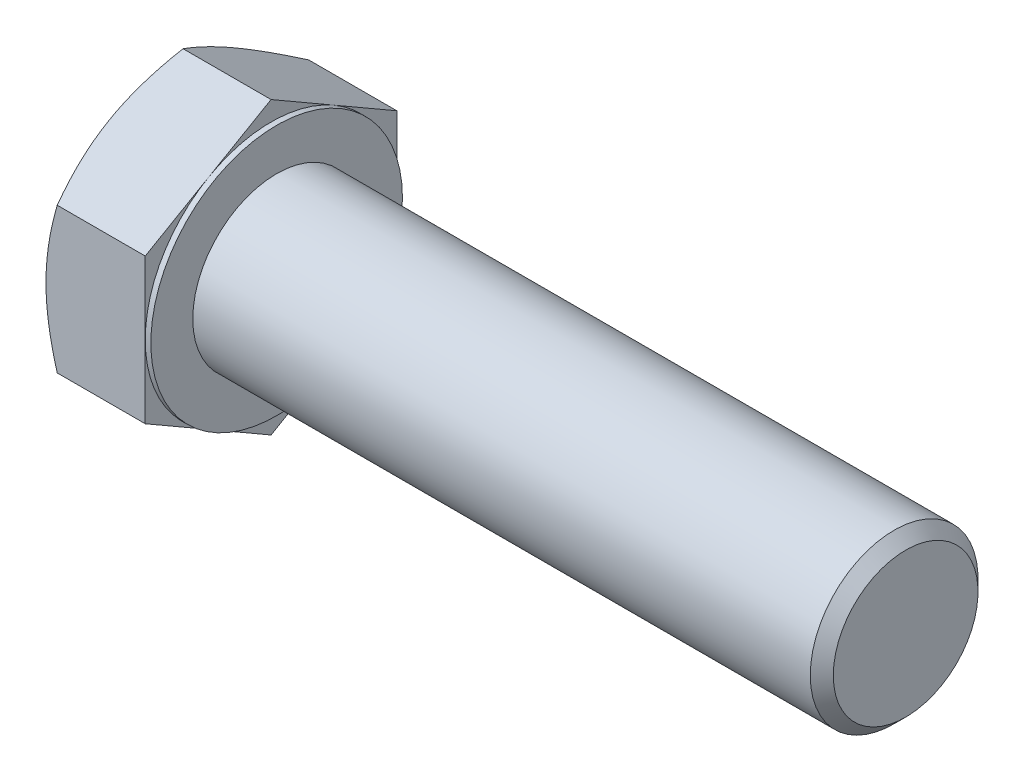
ISO-10303-21;
HEADER;
FILE_DESCRIPTION(('STEP AP214'),'2;1');
FILE_NAME('part.step','',(''),(''),'','','');
FILE_SCHEMA(('AUTOMOTIVE_DESIGN { 1 0 10303 214 1 1 1 1 }'));
ENDSEC;
DATA;
#1=APPLICATION_CONTEXT('core data for automotive mechanical design processes');
#2=APPLICATION_PROTOCOL_DEFINITION('international standard','automotive_design',2000,#1);
#3=PRODUCT_CONTEXT('',#1,'mechanical');
#4=PRODUCT('Part','Part','',(#3));
#5=PRODUCT_RELATED_PRODUCT_CATEGORY('part','',(#4));
#6=PRODUCT_DEFINITION_FORMATION('','',#4);
#7=PRODUCT_DEFINITION_CONTEXT('part definition',#1,'design');
#8=PRODUCT_DEFINITION('design','',#6,#7);
#9=PRODUCT_DEFINITION_SHAPE('','',#8);
#10=(LENGTH_UNIT() NAMED_UNIT(*) SI_UNIT(.MILLI.,.METRE.));
#11=(NAMED_UNIT(*) PLANE_ANGLE_UNIT() SI_UNIT($,.RADIAN.));
#12=(NAMED_UNIT(*) SI_UNIT($,.STERADIAN.) SOLID_ANGLE_UNIT());
#13=UNCERTAINTY_MEASURE_WITH_UNIT(LENGTH_MEASURE(1.E-05),#10,'distance_accuracy_value','');
#14=(GEOMETRIC_REPRESENTATION_CONTEXT(3) GLOBAL_UNCERTAINTY_ASSIGNED_CONTEXT((#13)) GLOBAL_UNIT_ASSIGNED_CONTEXT((#10,
#11,#12)) REPRESENTATION_CONTEXT('',''));
#15=CARTESIAN_POINT('',(0.,0.,0.));
#16=DIRECTION('',(0.,0.,1.));
#17=DIRECTION('',(1.,0.,0.));
#18=AXIS2_PLACEMENT_3D('',#15,#16,#17);
#19=CARTESIAN_POINT('',(15.,20.7846096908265,0.));
#20=DIRECTION('',(1.,0.,0.));
#21=DIRECTION('',(0.,0.,-1.));
#22=AXIS2_PLACEMENT_3D('',#19,#20,#21);
#23=PLANE('',#22);
#24=CARTESIAN_POINT('',(15.,0.,0.));
#25=DIRECTION('',(1.,0.,0.));
#26=DIRECTION('',(0.,0.,-1.));
#27=AXIS2_PLACEMENT_3D('',#24,#25,#26);
#28=CIRCLE('',#27,12.);
#29=CARTESIAN_POINT('',(15.,0.,-12.));
#30=VERTEX_POINT('',#29);
#31=EDGE_CURVE('E287',#30,#30,#28,.F.);
#32=ORIENTED_EDGE('',*,*,#31,.T.);
#33=EDGE_LOOP('',(#32));
#34=FACE_BOUND('',#33,.T.);
#35=CARTESIAN_POINT('',(15.,0.,0.));
#36=DIRECTION('',(1.,0.,0.));
#37=DIRECTION('',(0.,0.,-1.));
#38=AXIS2_PLACEMENT_3D('',#35,#36,#37);
#39=CIRCLE('',#38,18.);
#40=CARTESIAN_POINT('',(15.,0.,-18.));
#41=VERTEX_POINT('',#40);
#42=EDGE_CURVE('E306',#41,#41,#39,.T.);
#43=ORIENTED_EDGE('',*,*,#42,.T.);
#44=EDGE_LOOP('',(#43));
#45=FACE_BOUND('',#44,.T.);
#46=ADVANCED_FACE('F41',(#34,#45),#23,.T.);
#47=CARTESIAN_POINT('',(0.,0.,0.));
#48=DIRECTION('',(-1.,0.,0.));
#49=DIRECTION('',(0.,0.,1.));
#50=AXIS2_PLACEMENT_3D('',#47,#48,#49);
#51=CYLINDRICAL_SURFACE('',#50,12.);
#52=ORIENTED_EDGE('',*,*,#31,.F.);
#53=EDGE_LOOP('',(#52));
#54=FACE_BOUND('',#53,.T.);
#55=CARTESIAN_POINT('',(103.352,0.,0.));
#56=DIRECTION('',(-1.,0.,0.));
#57=DIRECTION('',(0.,0.,1.));
#58=AXIS2_PLACEMENT_3D('',#55,#56,#57);
#59=CIRCLE('',#58,12.);
#60=CARTESIAN_POINT('',(103.352,0.,12.));
#61=VERTEX_POINT('',#60);
#62=EDGE_CURVE('E284',#61,#61,#59,.T.);
#63=ORIENTED_EDGE('',*,*,#62,.T.);
#64=EDGE_LOOP('',(#63));
#65=FACE_BOUND('',#64,.T.);
#66=ADVANCED_FACE('F256',(#54,#65),#51,.T.);
#67=CARTESIAN_POINT('',(105.,0.,0.));
#68=DIRECTION('',(-1.,0.,0.));
#69=DIRECTION('',(0.,0.,1.));
#70=AXIS2_PLACEMENT_3D('',#67,#68,#69);
#71=CONICAL_SURFACE('',#70,10.352,0.785398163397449);
#72=ORIENTED_EDGE('',*,*,#62,.F.);
#73=EDGE_LOOP('',(#72));
#74=FACE_BOUND('',#73,.T.);
#75=CARTESIAN_POINT('',(105.,0.,0.));
#76=DIRECTION('',(-1.,0.,0.));
#77=DIRECTION('',(0.,0.,1.));
#78=AXIS2_PLACEMENT_3D('',#75,#76,#77);
#79=CIRCLE('',#78,10.352);
#80=CARTESIAN_POINT('',(105.,0.,10.352));
#81=VERTEX_POINT('',#80);
#82=EDGE_CURVE('E282',#81,#81,#79,.T.);
#83=ORIENTED_EDGE('',*,*,#82,.T.);
#84=EDGE_LOOP('',(#83));
#85=FACE_BOUND('',#84,.T.);
#86=ADVANCED_FACE('F263',(#74,#85),#71,.T.);
#87=CARTESIAN_POINT('',(105.,0.,0.));
#88=DIRECTION('',(-1.,0.,0.));
#89=DIRECTION('',(0.,0.,1.));
#90=AXIS2_PLACEMENT_3D('',#87,#88,#89);
#91=PLANE('',#90);
#92=ORIENTED_EDGE('',*,*,#82,.F.);
#93=EDGE_LOOP('',(#92));
#94=FACE_BOUND('',#93,.T.);
#95=ADVANCED_FACE('F270',(#94),#91,.F.);
#96=CARTESIAN_POINT('',(14.2,18.,0.));
#97=DIRECTION('',(1.,0.,0.));
#98=DIRECTION('',(0.,0.,-1.));
#99=AXIS2_PLACEMENT_3D('',#96,#97,#98);
#100=PLANE('',#99);
#101=DIRECTION('',(0.,0.500000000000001,0.866025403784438));
#102=VECTOR('',#101,1.);
#103=CARTESIAN_POINT('',(14.2,10.3923048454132,-18.));
#104=LINE('',#103,#102);
#105=CARTESIAN_POINT('',(14.2,10.3923048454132,-18.));
#106=VERTEX_POINT('',#105);
#107=CARTESIAN_POINT('',(14.2,15.5884572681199,-9.00000000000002));
#108=VERTEX_POINT('',#107);
#109=EDGE_CURVE('E174',#106,#108,#104,.T.);
#110=ORIENTED_EDGE('',*,*,#109,.T.);
#111=CARTESIAN_POINT('',(14.2,0.,0.));
#112=DIRECTION('',(-1.,0.,0.));
#113=DIRECTION('',(0.,0.,1.));
#114=AXIS2_PLACEMENT_3D('',#111,#112,#113);
#115=CIRCLE('',#114,18.);
#116=CARTESIAN_POINT('',(14.2,0.,-18.));
#117=VERTEX_POINT('',#116);
#118=EDGE_CURVE('E57',#108,#117,#115,.T.);
#119=ORIENTED_EDGE('',*,*,#118,.T.);
#120=DIRECTION('',(0.,1.,0.));
#121=VECTOR('',#120,1.);
#122=CARTESIAN_POINT('',(14.2,10.3923048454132,-18.));
#123=LINE('',#122,#121);
#124=EDGE_CURVE('E46',#117,#106,#123,.T.);
#125=ORIENTED_EDGE('',*,*,#124,.T.);
#126=EDGE_LOOP('',(#110,#119,#125));
#127=FACE_BOUND('',#126,.T.);
#128=ADVANCED_FACE('F273',(#127),#100,.T.);
#129=CARTESIAN_POINT('',(14.2,20.7846096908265,0.));
#130=VERTEX_POINT('',#129);
#131=EDGE_CURVE('E172',#108,#130,#104,.T.);
#132=ORIENTED_EDGE('',*,*,#131,.T.);
#133=DIRECTION('',(0.,-0.500000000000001,0.866025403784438));
#134=VECTOR('',#133,1.);
#135=CARTESIAN_POINT('',(14.2,20.7846096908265,0.));
#136=LINE('',#135,#134);
#137=CARTESIAN_POINT('',(14.2,15.5884572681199,9.00000000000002));
#138=VERTEX_POINT('',#137);
#139=EDGE_CURVE('E171',#130,#138,#136,.T.);
#140=ORIENTED_EDGE('',*,*,#139,.T.);
#141=EDGE_CURVE('E160',#138,#108,#115,.T.);
#142=ORIENTED_EDGE('',*,*,#141,.T.);
#143=EDGE_LOOP('',(#132,#140,#142));
#144=FACE_BOUND('',#143,.T.);
#145=ADVANCED_FACE('F278',(#144),#100,.T.);
#146=CARTESIAN_POINT('',(14.2,10.3923048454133,18.));
#147=VERTEX_POINT('',#146);
#148=EDGE_CURVE('E139',#138,#147,#136,.T.);
#149=ORIENTED_EDGE('',*,*,#148,.T.);
#150=DIRECTION('',(0.,-1.,0.));
#151=VECTOR('',#150,1.);
#152=CARTESIAN_POINT('',(14.2,10.3923048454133,18.));
#153=LINE('',#152,#151);
#154=CARTESIAN_POINT('',(14.2,0.,18.));
#155=VERTEX_POINT('',#154);
#156=EDGE_CURVE('E133',#147,#155,#153,.T.);
#157=ORIENTED_EDGE('',*,*,#156,.T.);
#158=EDGE_CURVE('E137',#155,#138,#115,.T.);
#159=ORIENTED_EDGE('',*,*,#158,.T.);
#160=EDGE_LOOP('',(#149,#157,#159));
#161=FACE_BOUND('',#160,.T.);
#162=ADVANCED_FACE('F135',(#161),#100,.T.);
#163=CARTESIAN_POINT('',(14.2,-10.3923048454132,18.));
#164=VERTEX_POINT('',#163);
#165=EDGE_CURVE('E143',#155,#164,#153,.T.);
#166=ORIENTED_EDGE('',*,*,#165,.T.);
#167=DIRECTION('',(0.,-0.500000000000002,-0.866025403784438));
#168=VECTOR('',#167,1.);
#169=CARTESIAN_POINT('',(14.2,-20.7846096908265,0.));
#170=LINE('',#169,#168);
#171=CARTESIAN_POINT('',(14.2,-15.5884572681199,9.00000000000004));
#172=VERTEX_POINT('',#171);
#173=EDGE_CURVE('E150',#164,#172,#170,.T.);
#174=ORIENTED_EDGE('',*,*,#173,.T.);
#175=EDGE_CURVE('E147',#172,#155,#115,.T.);
#176=ORIENTED_EDGE('',*,*,#175,.T.);
#177=EDGE_LOOP('',(#166,#174,#176));
#178=FACE_BOUND('',#177,.T.);
#179=ADVANCED_FACE('F148',(#178),#100,.T.);
#180=CARTESIAN_POINT('',(14.2,-20.7846096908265,0.));
#181=VERTEX_POINT('',#180);
#182=EDGE_CURVE('E166',#172,#181,#170,.T.);
#183=ORIENTED_EDGE('',*,*,#182,.T.);
#184=DIRECTION('',(0.,0.5,-0.866025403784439));
#185=VECTOR('',#184,1.);
#186=CARTESIAN_POINT('',(14.2,-10.3923048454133,-18.));
#187=LINE('',#186,#185);
#188=CARTESIAN_POINT('',(14.2,-15.5884572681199,-9.));
#189=VERTEX_POINT('',#188);
#190=EDGE_CURVE('E342',#181,#189,#187,.T.);
#191=ORIENTED_EDGE('',*,*,#190,.T.);
#192=EDGE_CURVE('E154',#189,#172,#115,.T.);
#193=ORIENTED_EDGE('',*,*,#192,.T.);
#194=EDGE_LOOP('',(#183,#191,#193));
#195=FACE_BOUND('',#194,.T.);
#196=ADVANCED_FACE('F347',(#195),#100,.T.);
#197=CARTESIAN_POINT('',(14.2,-10.3923048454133,-18.));
#198=VERTEX_POINT('',#197);
#199=EDGE_CURVE('E161',#189,#198,#187,.T.);
#200=ORIENTED_EDGE('',*,*,#199,.T.);
#201=EDGE_CURVE('E11',#198,#117,#123,.T.);
#202=ORIENTED_EDGE('',*,*,#201,.T.);
#203=EDGE_CURVE('E360',#117,#189,#115,.T.);
#204=ORIENTED_EDGE('',*,*,#203,.T.);
#205=EDGE_LOOP('',(#200,#202,#204));
#206=FACE_BOUND('',#205,.T.);
#207=ADVANCED_FACE('F279',(#206),#100,.T.);
#208=CARTESIAN_POINT('',(0.,0.,0.));
#209=DIRECTION('',(-1.,0.,0.));
#210=DIRECTION('',(0.,0.,1.));
#211=AXIS2_PLACEMENT_3D('',#208,#209,#210);
#212=CYLINDRICAL_SURFACE('',#211,18.);
#213=ORIENTED_EDGE('',*,*,#118,.F.);
#214=ORIENTED_EDGE('',*,*,#141,.F.);
#215=ORIENTED_EDGE('',*,*,#158,.F.);
#216=ORIENTED_EDGE('',*,*,#175,.F.);
#217=ORIENTED_EDGE('',*,*,#192,.F.);
#218=ORIENTED_EDGE('',*,*,#203,.F.);
#219=EDGE_LOOP('',(#213,#214,#215,#216,#217,#218));
#220=FACE_BOUND('',#219,.T.);
#221=ORIENTED_EDGE('',*,*,#42,.F.);
#222=EDGE_LOOP('',(#221));
#223=FACE_BOUND('',#222,.T.);
#224=ADVANCED_FACE('F157',(#220,#223),#212,.T.);
#225=CARTESIAN_POINT('',(0.,20.7846096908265,0.));
#226=DIRECTION('',(1.,0.,0.));
#227=DIRECTION('',(0.,0.,-1.));
#228=AXIS2_PLACEMENT_3D('',#225,#226,#227);
#229=PLANE('',#228);
#230=CARTESIAN_POINT('',(0.,0.,0.));
#231=DIRECTION('',(1.,0.,0.));
#232=DIRECTION('',(0.,0.,-1.));
#233=AXIS2_PLACEMENT_3D('',#230,#231,#232);
#234=CIRCLE('',#233,18.);
#235=CARTESIAN_POINT('',(0.,0.,-18.));
#236=VERTEX_POINT('',#235);
#237=CARTESIAN_POINT('',(0.,15.5884572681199,-9.00000000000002));
#238=VERTEX_POINT('',#237);
#239=EDGE_CURVE('E305',#236,#238,#234,.T.);
#240=ORIENTED_EDGE('',*,*,#239,.F.);
#241=CARTESIAN_POINT('',(0.,-15.5884572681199,-9.));
#242=VERTEX_POINT('',#241);
#243=EDGE_CURVE('E302',#242,#236,#234,.T.);
#244=ORIENTED_EDGE('',*,*,#243,.F.);
#245=CARTESIAN_POINT('',(0.,-15.5884572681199,9.00000000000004));
#246=VERTEX_POINT('',#245);
#247=EDGE_CURVE('E304',#246,#242,#234,.T.);
#248=ORIENTED_EDGE('',*,*,#247,.F.);
#249=CARTESIAN_POINT('',(0.,0.,18.));
#250=VERTEX_POINT('',#249);
#251=EDGE_CURVE('E314',#250,#246,#234,.T.);
#252=ORIENTED_EDGE('',*,*,#251,.F.);
#253=CARTESIAN_POINT('',(0.,0.,0.));
#254=DIRECTION('',(-1.,0.,0.));
#255=DIRECTION('',(0.,0.,1.));
#256=AXIS2_PLACEMENT_3D('',#253,#254,#255);
#257=CIRCLE('',#256,18.);
#258=CARTESIAN_POINT('',(0.,15.5884572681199,9.00000000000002));
#259=VERTEX_POINT('',#258);
#260=EDGE_CURVE('E175',#250,#259,#257,.T.);
#261=ORIENTED_EDGE('',*,*,#260,.T.);
#262=EDGE_CURVE('E309',#238,#259,#234,.T.);
#263=ORIENTED_EDGE('',*,*,#262,.F.);
#264=EDGE_LOOP('',(#240,#244,#248,#252,#261,#263));
#265=FACE_BOUND('',#264,.T.);
#266=ADVANCED_FACE('F206',(#265),#229,.F.);
#267=CARTESIAN_POINT('',(0.,0.,0.));
#268=DIRECTION('',(1.,0.,0.));
#269=DIRECTION('',(0.,0.,-1.));
#270=AXIS2_PLACEMENT_3D('',#267,#268,#269);
#271=CONICAL_SURFACE('',#270,18.,1.0471975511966);
#272=CARTESIAN_POINT('',(1.60776182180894,10.3921893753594,18.0002));
#273=CARTESIAN_POINT('',(1.47589336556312,10.6206079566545,17.6045674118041));
#274=CARTESIAN_POINT('',(1.35000889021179,10.8499174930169,17.2073916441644));
#275=CARTESIAN_POINT('',(1.11187123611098,11.310375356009,16.4098552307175));
#276=CARTESIAN_POINT('',(0.999622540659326,11.5415242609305,16.0094935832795));
#277=CARTESIAN_POINT('',(0.790265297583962,12.0061075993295,15.2048116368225));
#278=CARTESIAN_POINT('',(0.693192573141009,12.2395460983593,14.8004842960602));
#279=CARTESIAN_POINT('',(0.51627174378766,12.7080451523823,13.9890201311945));
#280=CARTESIAN_POINT('',(0.436422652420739,12.9431056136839,13.5818834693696));
#281=CARTESIAN_POINT('',(0.297345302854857,13.4088255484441,12.7752328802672));
#282=CARTESIAN_POINT('',(0.237656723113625,13.6394504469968,12.3757788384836));
#283=CARTESIAN_POINT('',(0.137572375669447,14.1017570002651,11.5750403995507));
#284=CARTESIAN_POINT('',(0.0971769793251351,14.3334386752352,11.1737559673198));
#285=CARTESIAN_POINT('',(0.0366989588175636,14.7971912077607,10.3705130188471));
#286=CARTESIAN_POINT('',(0.0165921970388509,15.0292612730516,9.96855587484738));
#287=CARTESIAN_POINT('',(-0.0028761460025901,15.4936156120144,9.16427056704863));
#288=CARTESIAN_POINT('',(-0.00223836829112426,15.7258998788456,8.76194241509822));
#289=CARTESIAN_POINT('',(0.0183335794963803,16.1601606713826,8.00978065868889));
#290=CARTESIAN_POINT('',(0.0357591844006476,16.3621681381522,7.65989346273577));
#291=CARTESIAN_POINT('',(0.0859690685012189,16.765701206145,6.96095368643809));
#292=CARTESIAN_POINT('',(0.118753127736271,16.9672268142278,6.61190109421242));
#293=CARTESIAN_POINT('',(0.199111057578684,17.3697198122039,5.91476277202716));
#294=CARTESIAN_POINT('',(0.246698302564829,17.5706865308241,5.56667820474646));
#295=CARTESIAN_POINT('',(0.355822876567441,17.9716632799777,4.87216610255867));
#296=CARTESIAN_POINT('',(0.417360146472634,18.1716733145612,4.52573856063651));
#297=CARTESIAN_POINT('',(0.624462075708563,18.7788295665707,3.47411308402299));
#298=CARTESIAN_POINT('',(0.790677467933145,19.1842175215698,2.77196054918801));
#299=CARTESIAN_POINT('',(1.1679181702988,19.9889486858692,1.37812528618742));
#300=CARTESIAN_POINT('',(1.3788548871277,20.3883021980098,0.686424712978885));
#301=CARTESIAN_POINT('',(1.60776182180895,20.7847251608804,-0.000200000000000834));
#302=B_SPLINE_CURVE_WITH_KNOTS('',3,(#272,#273,#274,#275,#276,#277,#278,#279,#280,#281,#282,
#283,#284,#285,#286,#287,#288,#289,#290,#291,#292,#293,#294,#295,#296,#297,#298,#299,#300,#301),
.UNSPECIFIED.,.F.,.F.,(4,2,2,2,2,2,2,2,2,2,2,2,2,2,4),(0.,1.42650335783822,2.85347447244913,
4.28376471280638,5.71397301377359,7.10888071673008,8.50381526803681,9.8970882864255,
11.2903182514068,12.5031974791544,13.7160593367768,14.9300201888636,16.1439758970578,
18.6253607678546,21.1018751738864),.UNSPECIFIED.);
#303=CARTESIAN_POINT('',(1.60769515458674,20.7846096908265,0.));
#304=VERTEX_POINT('',#303);
#305=EDGE_CURVE('E225',#259,#304,#302,.T.);
#306=ORIENTED_EDGE('',*,*,#305,.T.);
#307=CARTESIAN_POINT('',(1.60776182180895,20.7847251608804,0.0002));
#308=CARTESIAN_POINT('',(1.47589336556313,20.5563065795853,-0.395432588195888));
#309=CARTESIAN_POINT('',(1.3500088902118,20.3269970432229,-0.79260835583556));
#310=CARTESIAN_POINT('',(1.11187123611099,19.8665391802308,-1.59014476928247));
#311=CARTESIAN_POINT('',(0.999622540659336,19.6353902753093,-1.99050641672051));
#312=CARTESIAN_POINT('',(0.790265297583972,19.1708069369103,-2.79518836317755));
#313=CARTESIAN_POINT('',(0.69319257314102,18.9373684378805,-3.19951570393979));
#314=CARTESIAN_POINT('',(0.516271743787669,18.4688693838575,-4.01097986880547));
#315=CARTESIAN_POINT('',(0.436422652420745,18.2338089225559,-4.41811653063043));
#316=CARTESIAN_POINT('',(0.297345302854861,17.7680889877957,-5.22476711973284));
#317=CARTESIAN_POINT('',(0.237656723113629,17.537464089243,-5.62422116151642));
#318=CARTESIAN_POINT('',(0.13757237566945,17.0751575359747,-6.42495960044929));
#319=CARTESIAN_POINT('',(0.0971769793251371,16.8434758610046,-6.82624403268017));
#320=CARTESIAN_POINT('',(0.0366989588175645,16.3797233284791,-7.62948698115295));
#321=CARTESIAN_POINT('',(0.0165921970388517,16.1476532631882,-8.03144412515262));
#322=CARTESIAN_POINT('',(-0.00287614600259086,15.6832989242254,-8.83572943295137));
#323=CARTESIAN_POINT('',(-0.00223836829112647,15.4510146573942,-9.23805758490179));
#324=CARTESIAN_POINT('',(0.0183335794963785,15.0167538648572,-9.99021934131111));
#325=CARTESIAN_POINT('',(0.0357591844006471,14.8147463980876,-10.3401065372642));
#326=CARTESIAN_POINT('',(0.0859690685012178,14.4112133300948,-11.0390463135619));
#327=CARTESIAN_POINT('',(0.118753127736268,14.209687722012,-11.3880989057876));
#328=CARTESIAN_POINT('',(0.199111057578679,13.8071947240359,-12.0852372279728));
#329=CARTESIAN_POINT('',(0.246698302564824,13.6062280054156,-12.4333217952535));
#330=CARTESIAN_POINT('',(0.355822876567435,13.2052512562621,-13.1278338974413));
#331=CARTESIAN_POINT('',(0.417360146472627,13.0052412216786,-13.4742614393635));
#332=CARTESIAN_POINT('',(0.624462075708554,12.3980849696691,-14.525886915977));
#333=CARTESIAN_POINT('',(0.790677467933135,11.99269701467,-15.228039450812));
#334=CARTESIAN_POINT('',(1.16791817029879,11.1879658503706,-16.6218747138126));
#335=CARTESIAN_POINT('',(1.37885488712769,10.78861233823,-17.3135752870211));
#336=CARTESIAN_POINT('',(1.60776182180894,10.3921893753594,-18.0002));
#337=B_SPLINE_CURVE_WITH_KNOTS('',3,(#307,#308,#309,#310,#311,#312,#313,#314,#315,#316,#317,
#318,#319,#320,#321,#322,#323,#324,#325,#326,#327,#328,#329,#330,#331,#332,#333,#334,#335,#336),
.UNSPECIFIED.,.F.,.F.,(4,2,2,2,2,2,2,2,2,2,2,2,2,2,4),(0.,1.42650335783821,2.85347447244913,
4.28376471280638,5.71397301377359,7.10888071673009,8.50381526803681,9.89708828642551,
11.2903182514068,12.5031974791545,13.7160593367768,14.9300201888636,16.1439758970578,
18.6253607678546,21.1018751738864),.UNSPECIFIED.);
#338=EDGE_CURVE('E65',#304,#238,#337,.T.);
#339=ORIENTED_EDGE('',*,*,#338,.T.);
#340=ORIENTED_EDGE('',*,*,#262,.T.);
#341=EDGE_LOOP('',(#306,#339,#340));
#342=FACE_BOUND('',#341,.T.);
#343=ADVANCED_FACE('F356',(#342),#271,.T.);
#344=CARTESIAN_POINT('',(8.808427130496,-27.9643402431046,18.));
#345=CARTESIAN_POINT('',(8.61750677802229,-27.5710662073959,18.));
#346=CARTESIAN_POINT('',(8.42753472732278,-27.1773320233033,18.));
#347=CARTESIAN_POINT('',(8.04970189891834,-26.3888473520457,18.));
#348=CARTESIAN_POINT('',(7.86184114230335,-25.9940968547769,18.));
#349=CARTESIAN_POINT('',(7.30169863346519,-24.8080724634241,18.));
#350=CARTESIAN_POINT('',(6.93291289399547,-24.0151412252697,18.));
#351=CARTESIAN_POINT('',(6.20490967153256,-22.4196974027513,18.));
#352=CARTESIAN_POINT('',(5.84575478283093,-21.6171561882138,18.));
#353=CARTESIAN_POINT('',(5.14207064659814,-20.0057089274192,18.));
#354=CARTESIAN_POINT('',(4.79754071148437,-19.1968031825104,18.));
#355=CARTESIAN_POINT('',(4.11611022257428,-17.5450041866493,18.));
#356=CARTESIAN_POINT('',(3.77981809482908,-16.7018586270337,18.));
#357=CARTESIAN_POINT('',(3.13256514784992,-15.0057154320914,18.));
#358=CARTESIAN_POINT('',(2.82160716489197,-14.1527167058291,18.));
#359=CARTESIAN_POINT('',(2.23315455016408,-12.43711867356,18.));
#360=CARTESIAN_POINT('',(1.95559259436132,-11.5745426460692,18.));
#361=CARTESIAN_POINT('',(1.44279031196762,-9.83693542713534,18.));
#362=CARTESIAN_POINT('',(1.20753670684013,-8.96190823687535,18.));
#363=CARTESIAN_POINT('',(0.895522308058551,-7.64230427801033,18.));
#364=CARTESIAN_POINT('',(0.798539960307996,-7.20248011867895,18.));
#365=CARTESIAN_POINT('',(0.619346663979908,-6.31981731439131,18.));
#366=CARTESIAN_POINT('',(0.537135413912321,-5.87697873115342,18.));
#367=CARTESIAN_POINT('',(0.388933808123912,-4.98859702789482,18.));
#368=CARTESIAN_POINT('',(0.322942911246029,-4.54305399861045,18.));
#369=CARTESIAN_POINT('',(0.208492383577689,-3.64970631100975,18.));
#370=CARTESIAN_POINT('',(0.160032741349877,-3.20190165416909,18.));
#371=CARTESIAN_POINT('',(0.0822220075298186,-2.3105496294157,18.));
#372=CARTESIAN_POINT('',(0.0526283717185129,-1.86702356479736,18.));
#373=CARTESIAN_POINT('',(0.0122265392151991,-0.979118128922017,18.));
#374=CARTESIAN_POINT('',(0.001418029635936,-0.534738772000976,18.));
#375=CARTESIAN_POINT('',(-0.00115631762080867,0.354079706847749,18.));
#376=CARTESIAN_POINT('',(0.00707792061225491,0.798518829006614,18.));
#377=CARTESIAN_POINT('',(0.0423876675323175,1.68665283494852,18.));
#378=CARTESIAN_POINT('',(0.0694640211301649,2.13034768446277,18.));
#379=CARTESIAN_POINT('',(0.156482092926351,3.19520589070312,18.));
#380=CARTESIAN_POINT('',(0.225281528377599,3.81565824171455,18.));
#381=CARTESIAN_POINT('',(0.395990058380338,5.05199420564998,18.));
#382=CARTESIAN_POINT('',(0.497903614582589,5.66787719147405,18.));
#383=CARTESIAN_POINT('',(0.731215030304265,6.89447554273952,18.));
#384=CARTESIAN_POINT('',(0.862635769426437,7.50518651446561,18.));
#385=CARTESIAN_POINT('',(1.15094813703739,8.72049972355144,18.));
#386=CARTESIAN_POINT('',(1.30783938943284,9.3251020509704,18.));
#387=CARTESIAN_POINT('',(1.64698004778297,10.5414936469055,18.));
#388=CARTESIAN_POINT('',(1.82971241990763,11.1531473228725,18.));
#389=CARTESIAN_POINT('',(2.21414736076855,12.3704299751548,18.));
#390=CARTESIAN_POINT('',(2.41585005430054,12.9760589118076,18.));
#391=CARTESIAN_POINT('',(2.83501520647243,14.1815895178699,18.));
#392=CARTESIAN_POINT('',(3.05247247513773,14.7814930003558,18.));
#393=CARTESIAN_POINT('',(3.50057968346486,15.9763233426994,18.));
#394=CARTESIAN_POINT('',(3.73122947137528,16.5712502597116,18.));
#395=CARTESIAN_POINT('',(4.28861115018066,17.9702204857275,18.));
#396=CARTESIAN_POINT('',(4.62002515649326,18.7723954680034,18.));
#397=CARTESIAN_POINT('',(5.29890820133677,20.3699430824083,18.));
#398=CARTESIAN_POINT('',(5.64637822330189,21.1653152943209,18.));
#399=CARTESIAN_POINT('',(6.35417286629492,22.7505167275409,18.));
#400=CARTESIAN_POINT('',(6.7145003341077,23.5403446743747,18.));
#401=CARTESIAN_POINT('',(7.44542750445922,25.1152008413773,18.));
#402=CARTESIAN_POINT('',(7.81602698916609,25.9002291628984,18.));
#403=CARTESIAN_POINT('',(8.56599428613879,27.4671332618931,18.));
#404=CARTESIAN_POINT('',(8.94537123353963,28.2490046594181,18.));
#405=CARTESIAN_POINT('',(9.71100797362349,29.8093695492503,18.));
#406=CARTESIAN_POINT('',(10.0972677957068,30.5878630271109,18.));
#407=CARTESIAN_POINT('',(10.8754456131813,32.1418914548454,18.));
#408=CARTESIAN_POINT('',(11.2673628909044,32.9174267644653,18.));
#409=CARTESIAN_POINT('',(12.0559785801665,34.4660583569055,18.));
#410=CARTESIAN_POINT('',(12.4526769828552,35.2391546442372,18.));
#411=CARTESIAN_POINT('',(13.5822142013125,37.4263866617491,18.));
#412=CARTESIAN_POINT('',(14.3197969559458,38.8380724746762,18.));
#413=CARTESIAN_POINT('',(15.8050655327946,41.6561700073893,18.));
#414=CARTESIAN_POINT('',(16.5527517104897,43.0625815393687,18.));
#415=CARTESIAN_POINT('',(18.0539928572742,45.8677641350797,18.));
#416=CARTESIAN_POINT('',(18.8075285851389,47.2665455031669,18.));
#417=CARTESIAN_POINT('',(19.942334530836,49.3622270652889,18.));
#418=CARTESIAN_POINT('',(20.3213432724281,50.0603536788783,18.));
#419=CARTESIAN_POINT('',(21.0807116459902,51.4558704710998,18.));
#420=CARTESIAN_POINT('',(21.4610712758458,52.1532606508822,18.));
#421=CARTESIAN_POINT('',(21.8420286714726,52.850324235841,18.));
#422=B_SPLINE_CURVE_WITH_KNOTS('',3,(#344,#345,#346,#347,#348,#349,#350,#351,#352,#353,#354,
#355,#356,#357,#358,#359,#360,#361,#362,#363,#364,#365,#366,#367,#368,#369,#370,#371,#372,#373,
#374,#375,#376,#377,#378,#379,#380,#381,#382,#383,#384,#385,#386,#387,#388,#389,#390,#391,#392,
#393,#394,#395,#396,#397,#398,#399,#400,#401,#402,#403,#404,#405,#406,#407,#408,#409,#410,#411,
#412,#413,#414,#415,#416,#417,#418,#419,#420,#421),.UNSPECIFIED.,.F.,.F.,(4,2,2,2,2,2,2,2,2,2,2,
2,2,2,2,2,2,2,2,2,2,2,2,2,2,2,2,2,2,2,2,2,2,2,2,2,2,2,4),(0.,1.31149885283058,2.62301079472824,
5.24642021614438,7.88402931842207,10.5215142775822,13.2444150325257,15.9676202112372,
18.6852401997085,21.402005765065,22.7529669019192,24.1039004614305,25.454788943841,
26.8056765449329,28.1388267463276,29.4719547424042,30.8050880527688,32.138281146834,
34.0100119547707,35.8819950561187,37.7554347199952,39.628846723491,41.5435776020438,
43.4583210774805,45.3724366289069,47.286530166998,49.890113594,52.4938567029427,
55.0981799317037,57.7024479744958,60.3095605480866,62.9166842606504,65.5234801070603,
68.1302711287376,72.908489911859,77.6868772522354,82.4533702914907,84.8364880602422,
87.2196021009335),.UNSPECIFIED.);
#423=CARTESIAN_POINT('',(1.60769515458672,10.3923048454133,18.));
#424=VERTEX_POINT('',#423);
#425=EDGE_CURVE('E239',#250,#424,#422,.T.);
#426=ORIENTED_EDGE('',*,*,#425,.T.);
#427=EDGE_CURVE('E238',#424,#259,#302,.T.);
#428=ORIENTED_EDGE('',*,*,#427,.T.);
#429=ORIENTED_EDGE('',*,*,#260,.F.);
#430=EDGE_LOOP('',(#426,#428,#429));
#431=FACE_BOUND('',#430,.T.);
#432=ADVANCED_FACE('F352',(#431),#271,.T.);
#433=CARTESIAN_POINT('',(1.60769515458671,-10.3923048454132,18.));
#434=VERTEX_POINT('',#433);
#435=EDGE_CURVE('E285',#434,#250,#422,.T.);
#436=ORIENTED_EDGE('',*,*,#435,.T.);
#437=ORIENTED_EDGE('',*,*,#251,.T.);
#438=CARTESIAN_POINT('',(1.60776182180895,-20.7847251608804,-0.000200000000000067));
#439=CARTESIAN_POINT('',(1.47589336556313,-20.5563065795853,0.395432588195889));
#440=CARTESIAN_POINT('',(1.3500088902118,-20.3269970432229,0.79260835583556));
#441=CARTESIAN_POINT('',(1.11187123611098,-19.8665391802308,1.59014476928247));
#442=CARTESIAN_POINT('',(0.999622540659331,-19.6353902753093,1.99050641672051));
#443=CARTESIAN_POINT('',(0.790265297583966,-19.1708069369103,2.79518836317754));
#444=CARTESIAN_POINT('',(0.693192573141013,-18.9373684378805,3.19951570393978));
#445=CARTESIAN_POINT('',(0.516271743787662,-18.4688693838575,4.01097986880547));
#446=CARTESIAN_POINT('',(0.43642265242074,-18.2338089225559,4.41811653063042));
#447=CARTESIAN_POINT('',(0.297345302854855,-17.7680889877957,5.22476711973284));
#448=CARTESIAN_POINT('',(0.237656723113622,-17.537464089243,5.62422116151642));
#449=CARTESIAN_POINT('',(0.137572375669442,-17.0751575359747,6.42495960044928));
#450=CARTESIAN_POINT('',(0.0971769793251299,-16.8434758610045,6.82624403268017));
#451=CARTESIAN_POINT('',(0.0366989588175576,-16.3797233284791,7.62948698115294));
#452=CARTESIAN_POINT('',(0.0165921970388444,-16.1476532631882,8.03144412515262));
#453=CARTESIAN_POINT('',(-0.00287614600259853,-15.6832989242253,8.83572943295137));
#454=CARTESIAN_POINT('',(-0.00223836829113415,-15.4510146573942,9.23805758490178));
#455=CARTESIAN_POINT('',(0.0183335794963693,-15.0167538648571,9.9902193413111));
#456=CARTESIAN_POINT('',(0.0357591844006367,-14.8147463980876,10.3401065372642));
#457=CARTESIAN_POINT('',(0.0859690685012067,-14.4112133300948,11.0390463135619));
#458=CARTESIAN_POINT('',(0.118753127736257,-14.209687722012,11.3880989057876));
#459=CARTESIAN_POINT('',(0.199111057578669,-13.8071947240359,12.0852372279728));
#460=CARTESIAN_POINT('',(0.246698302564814,-13.6062280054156,12.4333217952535));
#461=CARTESIAN_POINT('',(0.355822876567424,-13.2052512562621,13.1278338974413));
#462=CARTESIAN_POINT('',(0.417360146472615,-13.0052412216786,13.4742614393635));
#463=CARTESIAN_POINT('',(0.624462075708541,-12.3980849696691,14.525886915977));
#464=CARTESIAN_POINT('',(0.790677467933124,-11.99269701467,15.228039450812));
#465=CARTESIAN_POINT('',(1.16791817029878,-11.1879658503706,16.6218747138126));
#466=CARTESIAN_POINT('',(1.37885488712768,-10.78861233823,17.3135752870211));
#467=CARTESIAN_POINT('',(1.60776182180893,-10.3921893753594,18.0002));
#468=B_SPLINE_CURVE_WITH_KNOTS('',3,(#438,#439,#440,#441,#442,#443,#444,#445,#446,#447,#448,
#449,#450,#451,#452,#453,#454,#455,#456,#457,#458,#459,#460,#461,#462,#463,#464,#465,#466,#467),
.UNSPECIFIED.,.F.,.F.,(4,2,2,2,2,2,2,2,2,2,2,2,2,2,4),(0.,1.42650335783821,2.85347447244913,
4.28376471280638,5.71397301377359,7.10888071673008,8.50381526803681,9.89708828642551,
11.2903182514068,12.5031974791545,13.7160593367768,14.9300201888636,16.1439758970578,
18.6253607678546,21.1018751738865),.UNSPECIFIED.);
#469=EDGE_CURVE('E227',#246,#434,#468,.T.);
#470=ORIENTED_EDGE('',*,*,#469,.T.);
#471=EDGE_LOOP('',(#436,#437,#470));
#472=FACE_BOUND('',#471,.T.);
#473=ADVANCED_FACE('F195',(#472),#271,.T.);
#474=CARTESIAN_POINT('',(1.60769515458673,-20.7846096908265,0.));
#475=VERTEX_POINT('',#474);
#476=EDGE_CURVE('E219',#475,#246,#468,.T.);
#477=ORIENTED_EDGE('',*,*,#476,.T.);
#478=ORIENTED_EDGE('',*,*,#247,.T.);
#479=CARTESIAN_POINT('',(1.60776182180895,-10.3921893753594,-18.0002));
#480=CARTESIAN_POINT('',(1.47589336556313,-10.6206079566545,-17.6045674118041));
#481=CARTESIAN_POINT('',(1.3500088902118,-10.8499174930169,-17.2073916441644));
#482=CARTESIAN_POINT('',(1.11187123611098,-11.310375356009,-16.4098552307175));
#483=CARTESIAN_POINT('',(0.999622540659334,-11.5415242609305,-16.0094935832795));
#484=CARTESIAN_POINT('',(0.79026529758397,-12.0061075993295,-15.2048116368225));
#485=CARTESIAN_POINT('',(0.693192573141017,-12.2395460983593,-14.8004842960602));
#486=CARTESIAN_POINT('',(0.516271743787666,-12.7080451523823,-13.9890201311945));
#487=CARTESIAN_POINT('',(0.436422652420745,-12.9431056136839,-13.5818834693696));
#488=CARTESIAN_POINT('',(0.297345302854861,-13.4088255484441,-12.7752328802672));
#489=CARTESIAN_POINT('',(0.237656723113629,-13.6394504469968,-12.3757788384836));
#490=CARTESIAN_POINT('',(0.137572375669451,-14.1017570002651,-11.5750403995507));
#491=CARTESIAN_POINT('',(0.0971769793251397,-14.3334386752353,-11.1737559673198));
#492=CARTESIAN_POINT('',(0.036698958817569,-14.7971912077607,-10.370513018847));
#493=CARTESIAN_POINT('',(0.0165921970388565,-15.0292612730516,-9.96855587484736));
#494=CARTESIAN_POINT('',(-0.00287614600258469,-15.4936156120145,-9.16427056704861));
#495=CARTESIAN_POINT('',(-0.00223836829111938,-15.7258998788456,-8.7619424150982));
#496=CARTESIAN_POINT('',(0.0183335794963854,-16.1601606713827,-8.00978065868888));
#497=CARTESIAN_POINT('',(0.0357591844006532,-16.3621681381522,-7.65989346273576));
#498=CARTESIAN_POINT('',(0.0859690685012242,-16.765701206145,-6.96095368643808));
#499=CARTESIAN_POINT('',(0.118753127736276,-16.9672268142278,-6.61190109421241));
#500=CARTESIAN_POINT('',(0.199111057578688,-17.3697198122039,-5.91476277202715));
#501=CARTESIAN_POINT('',(0.246698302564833,-17.5706865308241,-5.56667820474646));
#502=CARTESIAN_POINT('',(0.355822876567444,-17.9716632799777,-4.87216610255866));
#503=CARTESIAN_POINT('',(0.417360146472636,-18.1716733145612,-4.5257385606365));
#504=CARTESIAN_POINT('',(0.624462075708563,-18.7788295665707,-3.47411308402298));
#505=CARTESIAN_POINT('',(0.790677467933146,-19.1842175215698,-2.77196054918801));
#506=CARTESIAN_POINT('',(1.1679181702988,-19.9889486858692,-1.37812528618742));
#507=CARTESIAN_POINT('',(1.3788548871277,-20.3883021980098,-0.686424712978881));
#508=CARTESIAN_POINT('',(1.60776182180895,-20.7847251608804,0.000200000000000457));
#509=B_SPLINE_CURVE_WITH_KNOTS('',3,(#479,#480,#481,#482,#483,#484,#485,#486,#487,#488,#489,
#490,#491,#492,#493,#494,#495,#496,#497,#498,#499,#500,#501,#502,#503,#504,#505,#506,#507,#508),
.UNSPECIFIED.,.F.,.F.,(4,2,2,2,2,2,2,2,2,2,2,2,2,2,4),(0.,1.42650335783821,2.85347447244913,
4.28376471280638,5.71397301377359,7.10888071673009,8.50381526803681,9.89708828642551,
11.2903182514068,12.5031974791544,13.7160593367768,14.9300201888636,16.1439758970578,
18.6253607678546,21.1018751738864),.UNSPECIFIED.);
#510=EDGE_CURVE('E226',#242,#475,#509,.T.);
#511=ORIENTED_EDGE('',*,*,#510,.T.);
#512=EDGE_LOOP('',(#477,#478,#511));
#513=FACE_BOUND('',#512,.T.);
#514=ADVANCED_FACE('F323',(#513),#271,.T.);
#515=CARTESIAN_POINT('',(1.60769515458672,10.3923048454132,-18.));
#516=VERTEX_POINT('',#515);
#517=EDGE_CURVE('E228',#238,#516,#337,.T.);
#518=ORIENTED_EDGE('',*,*,#517,.T.);
#519=CARTESIAN_POINT('',(8.80842713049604,-27.9643402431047,-18.));
#520=CARTESIAN_POINT('',(8.61750677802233,-27.5710662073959,-18.));
#521=CARTESIAN_POINT('',(8.42753472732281,-27.1773320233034,-18.));
#522=CARTESIAN_POINT('',(8.04970189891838,-26.3888473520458,-18.));
#523=CARTESIAN_POINT('',(7.86184114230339,-25.994096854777,-18.));
#524=CARTESIAN_POINT('',(7.30169863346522,-24.8080724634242,-18.));
#525=CARTESIAN_POINT('',(6.9329128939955,-24.0151412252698,-18.));
#526=CARTESIAN_POINT('',(6.20490967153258,-22.4196974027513,-18.));
#527=CARTESIAN_POINT('',(5.84575478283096,-21.6171561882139,-18.));
#528=CARTESIAN_POINT('',(5.14207064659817,-20.0057089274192,-18.));
#529=CARTESIAN_POINT('',(4.79754071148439,-19.1968031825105,-18.));
#530=CARTESIAN_POINT('',(4.11611022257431,-17.5450041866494,-18.));
#531=CARTESIAN_POINT('',(3.7798180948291,-16.7018586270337,-18.));
#532=CARTESIAN_POINT('',(3.13256514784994,-15.0057154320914,-18.));
#533=CARTESIAN_POINT('',(2.82160716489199,-14.1527167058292,-18.));
#534=CARTESIAN_POINT('',(2.23315455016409,-12.4371186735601,-18.));
#535=CARTESIAN_POINT('',(1.95559259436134,-11.5745426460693,-18.));
#536=CARTESIAN_POINT('',(1.44279031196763,-9.83693542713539,-18.));
#537=CARTESIAN_POINT('',(1.20753670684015,-8.9619082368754,-18.));
#538=CARTESIAN_POINT('',(0.895522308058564,-7.64230427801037,-18.));
#539=CARTESIAN_POINT('',(0.79853996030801,-7.202480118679,-18.));
#540=CARTESIAN_POINT('',(0.619346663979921,-6.31981731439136,-18.));
#541=CARTESIAN_POINT('',(0.537135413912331,-5.87697873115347,-18.));
#542=CARTESIAN_POINT('',(0.38893380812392,-4.98859702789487,-18.));
#543=CARTESIAN_POINT('',(0.322942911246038,-4.5430539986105,-18.));
#544=CARTESIAN_POINT('',(0.208492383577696,-3.64970631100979,-18.));
#545=CARTESIAN_POINT('',(0.160032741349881,-3.20190165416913,-18.));
#546=CARTESIAN_POINT('',(0.0822220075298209,-2.31054962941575,-18.));
#547=CARTESIAN_POINT('',(0.0526283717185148,-1.8670235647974,-18.));
#548=CARTESIAN_POINT('',(0.0122265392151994,-0.979118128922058,-18.));
#549=CARTESIAN_POINT('',(0.00141802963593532,-0.534738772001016,-18.));
#550=CARTESIAN_POINT('',(-0.00115631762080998,0.354079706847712,-18.));
#551=CARTESIAN_POINT('',(0.00707792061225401,0.798518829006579,-18.));
#552=CARTESIAN_POINT('',(0.0423876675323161,1.68665283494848,-18.));
#553=CARTESIAN_POINT('',(0.0694640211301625,2.13034768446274,-18.));
#554=CARTESIAN_POINT('',(0.156482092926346,3.19520589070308,-18.));
#555=CARTESIAN_POINT('',(0.225281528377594,3.81565824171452,-18.));
#556=CARTESIAN_POINT('',(0.395990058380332,5.05199420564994,-18.));
#557=CARTESIAN_POINT('',(0.497903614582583,5.66787719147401,-18.));
#558=CARTESIAN_POINT('',(0.731215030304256,6.89447554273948,-18.));
#559=CARTESIAN_POINT('',(0.862635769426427,7.50518651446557,-18.));
#560=CARTESIAN_POINT('',(1.15094813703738,8.72049972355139,-18.));
#561=CARTESIAN_POINT('',(1.30783938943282,9.32510205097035,-18.));
#562=CARTESIAN_POINT('',(1.64698004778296,10.5414936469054,-18.));
#563=CARTESIAN_POINT('',(1.82971241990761,11.1531473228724,-18.));
#564=CARTESIAN_POINT('',(2.21414736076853,12.3704299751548,-18.));
#565=CARTESIAN_POINT('',(2.41585005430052,12.9760589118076,-18.));
#566=CARTESIAN_POINT('',(2.83501520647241,14.1815895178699,-18.));
#567=CARTESIAN_POINT('',(3.05247247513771,14.7814930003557,-18.));
#568=CARTESIAN_POINT('',(3.50057968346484,15.9763233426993,-18.));
#569=CARTESIAN_POINT('',(3.73122947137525,16.5712502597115,-18.));
#570=CARTESIAN_POINT('',(4.28861115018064,17.9702204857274,-18.));
#571=CARTESIAN_POINT('',(4.62002515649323,18.7723954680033,-18.));
#572=CARTESIAN_POINT('',(5.29890820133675,20.3699430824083,-18.));
#573=CARTESIAN_POINT('',(5.64637822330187,21.1653152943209,-18.));
#574=CARTESIAN_POINT('',(6.3541728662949,22.7505167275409,-18.));
#575=CARTESIAN_POINT('',(6.71450033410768,23.5403446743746,-18.));
#576=CARTESIAN_POINT('',(7.4454275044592,25.1152008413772,-18.));
#577=CARTESIAN_POINT('',(7.81602698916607,25.9002291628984,-18.));
#578=CARTESIAN_POINT('',(8.56599428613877,27.467133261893,-18.));
#579=CARTESIAN_POINT('',(8.94537123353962,28.2490046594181,-18.));
#580=CARTESIAN_POINT('',(9.71100797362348,29.8093695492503,-18.));
#581=CARTESIAN_POINT('',(10.0972677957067,30.5878630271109,-18.));
#582=CARTESIAN_POINT('',(10.8754456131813,32.1418914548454,-18.));
#583=CARTESIAN_POINT('',(11.2673628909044,32.9174267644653,-18.));
#584=CARTESIAN_POINT('',(12.0559785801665,34.4660583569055,-18.));
#585=CARTESIAN_POINT('',(12.4526769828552,35.2391546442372,-18.));
#586=CARTESIAN_POINT('',(13.5822142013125,37.4263866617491,-18.));
#587=CARTESIAN_POINT('',(14.3197969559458,38.8380724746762,-18.));
#588=CARTESIAN_POINT('',(15.8050655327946,41.6561700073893,-18.));
#589=CARTESIAN_POINT('',(16.5527517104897,43.0625815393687,-18.));
#590=CARTESIAN_POINT('',(18.0539928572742,45.8677641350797,-18.));
#591=CARTESIAN_POINT('',(18.8075285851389,47.2665455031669,-18.));
#592=CARTESIAN_POINT('',(19.942334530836,49.3622270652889,-18.));
#593=CARTESIAN_POINT('',(20.3213432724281,50.0603536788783,-18.));
#594=CARTESIAN_POINT('',(21.0807116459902,51.4558704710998,-18.));
#595=CARTESIAN_POINT('',(21.4610712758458,52.1532606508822,-18.));
#596=CARTESIAN_POINT('',(21.8420286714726,52.850324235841,-18.));
#597=B_SPLINE_CURVE_WITH_KNOTS('',3,(#519,#520,#521,#522,#523,#524,#525,#526,#527,#528,#529,
#530,#531,#532,#533,#534,#535,#536,#537,#538,#539,#540,#541,#542,#543,#544,#545,#546,#547,#548,
#549,#550,#551,#552,#553,#554,#555,#556,#557,#558,#559,#560,#561,#562,#563,#564,#565,#566,#567,
#568,#569,#570,#571,#572,#573,#574,#575,#576,#577,#578,#579,#580,#581,#582,#583,#584,#585,#586,
#587,#588,#589,#590,#591,#592,#593,#594,#595,#596),.UNSPECIFIED.,.F.,.F.,(4,2,2,2,2,2,2,2,2,2,2,
2,2,2,2,2,2,2,2,2,2,2,2,2,2,2,2,2,2,2,2,2,2,2,2,2,2,2,4),(0.,1.31149885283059,2.62301079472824,
5.24642021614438,7.88402931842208,10.5215142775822,13.2444150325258,15.9676202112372,
18.6852401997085,21.402005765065,22.7529669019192,24.1039004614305,25.454788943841,
26.805676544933,28.1388267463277,29.4719547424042,30.8050880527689,32.1382811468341,
34.0100119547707,35.8819950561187,37.7554347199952,39.628846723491,41.5435776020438,
43.4583210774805,45.3724366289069,47.286530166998,49.8901135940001,52.4938567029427,
55.0981799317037,57.7024479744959,60.3095605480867,62.9166842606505,65.5234801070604,
68.1302711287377,72.9084899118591,77.6868772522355,82.4533702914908,84.8364880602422,
87.2196021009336),.UNSPECIFIED.);
#598=EDGE_CURVE('E187',#516,#236,#597,.F.);
#599=ORIENTED_EDGE('',*,*,#598,.T.);
#600=ORIENTED_EDGE('',*,*,#239,.T.);
#601=EDGE_LOOP('',(#518,#599,#600));
#602=FACE_BOUND('',#601,.T.);
#603=ADVANCED_FACE('F337',(#602),#271,.T.);
#604=CARTESIAN_POINT('',(1.60769515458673,-10.3923048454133,-18.));
#605=VERTEX_POINT('',#604);
#606=EDGE_CURVE('E188',#605,#242,#509,.T.);
#607=ORIENTED_EDGE('',*,*,#606,.T.);
#608=ORIENTED_EDGE('',*,*,#243,.T.);
#609=EDGE_CURVE('E178',#236,#605,#597,.F.);
#610=ORIENTED_EDGE('',*,*,#609,.T.);
#611=EDGE_LOOP('',(#607,#608,#610));
#612=FACE_BOUND('',#611,.T.);
#613=ADVANCED_FACE('F204',(#612),#271,.T.);
#614=CARTESIAN_POINT('',(15.,10.3923048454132,-18.));
#615=DIRECTION('',(0.,0.,1.));
#616=DIRECTION('',(1.,0.,0.));
#617=AXIS2_PLACEMENT_3D('',#614,#615,#616);
#618=PLANE('',#617);
#619=ORIENTED_EDGE('',*,*,#201,.F.);
#620=DIRECTION('',(-1.,0.,0.));
#621=VECTOR('',#620,1.);
#622=CARTESIAN_POINT('',(15.,-10.3923048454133,-18.));
#623=LINE('',#622,#621);
#624=EDGE_CURVE('E293',#198,#605,#623,.T.);
#625=ORIENTED_EDGE('',*,*,#624,.T.);
#626=ORIENTED_EDGE('',*,*,#609,.F.);
#627=ORIENTED_EDGE('',*,*,#598,.F.);
#628=DIRECTION('',(-1.,0.,0.));
#629=VECTOR('',#628,1.);
#630=CARTESIAN_POINT('',(15.,10.3923048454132,-18.));
#631=LINE('',#630,#629);
#632=EDGE_CURVE('E291',#106,#516,#631,.T.);
#633=ORIENTED_EDGE('',*,*,#632,.F.);
#634=ORIENTED_EDGE('',*,*,#124,.F.);
#635=EDGE_LOOP('',(#619,#625,#626,#627,#633,#634));
#636=FACE_BOUND('',#635,.T.);
#637=ADVANCED_FACE('F199',(#636),#618,.F.);
#638=CARTESIAN_POINT('',(15.,-10.3923048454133,-18.));
#639=DIRECTION('',(0.,0.866025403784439,0.5));
#640=DIRECTION('',(0.,-0.5,0.866025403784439));
#641=AXIS2_PLACEMENT_3D('',#638,#639,#640);
#642=PLANE('',#641);
#643=ORIENTED_EDGE('',*,*,#190,.F.);
#644=DIRECTION('',(-1.,0.,0.));
#645=VECTOR('',#644,1.);
#646=CARTESIAN_POINT('',(15.,-20.7846096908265,0.));
#647=LINE('',#646,#645);
#648=EDGE_CURVE('E295',#181,#475,#647,.T.);
#649=ORIENTED_EDGE('',*,*,#648,.T.);
#650=ORIENTED_EDGE('',*,*,#510,.F.);
#651=ORIENTED_EDGE('',*,*,#606,.F.);
#652=ORIENTED_EDGE('',*,*,#624,.F.);
#653=ORIENTED_EDGE('',*,*,#199,.F.);
#654=EDGE_LOOP('',(#643,#649,#650,#651,#652,#653));
#655=FACE_BOUND('',#654,.T.);
#656=ADVANCED_FACE('F203',(#655),#642,.F.);
#657=CARTESIAN_POINT('',(15.,-20.7846096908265,0.));
#658=DIRECTION('',(0.,0.866025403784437,-0.500000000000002));
#659=DIRECTION('',(0.,0.500000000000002,0.866025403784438));
#660=AXIS2_PLACEMENT_3D('',#657,#658,#659);
#661=PLANE('',#660);
#662=ORIENTED_EDGE('',*,*,#173,.F.);
#663=DIRECTION('',(-1.,0.,0.));
#664=VECTOR('',#663,1.);
#665=CARTESIAN_POINT('',(15.,-10.3923048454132,18.));
#666=LINE('',#665,#664);
#667=EDGE_CURVE('E165',#164,#434,#666,.T.);
#668=ORIENTED_EDGE('',*,*,#667,.T.);
#669=ORIENTED_EDGE('',*,*,#469,.F.);
#670=ORIENTED_EDGE('',*,*,#476,.F.);
#671=ORIENTED_EDGE('',*,*,#648,.F.);
#672=ORIENTED_EDGE('',*,*,#182,.F.);
#673=EDGE_LOOP('',(#662,#668,#669,#670,#671,#672));
#674=FACE_BOUND('',#673,.T.);
#675=ADVANCED_FACE('F211',(#674),#661,.F.);
#676=CARTESIAN_POINT('',(15.,10.3923048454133,18.));
#677=DIRECTION('',(0.,0.,-1.));
#678=DIRECTION('',(0.,1.,0.));
#679=AXIS2_PLACEMENT_3D('',#676,#677,#678);
#680=PLANE('',#679);
#681=ORIENTED_EDGE('',*,*,#156,.F.);
#682=DIRECTION('',(-1.,0.,0.));
#683=VECTOR('',#682,1.);
#684=CARTESIAN_POINT('',(15.,10.3923048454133,18.));
#685=LINE('',#684,#683);
#686=EDGE_CURVE('E298',#147,#424,#685,.T.);
#687=ORIENTED_EDGE('',*,*,#686,.T.);
#688=ORIENTED_EDGE('',*,*,#425,.F.);
#689=ORIENTED_EDGE('',*,*,#435,.F.);
#690=ORIENTED_EDGE('',*,*,#667,.F.);
#691=ORIENTED_EDGE('',*,*,#165,.F.);
#692=EDGE_LOOP('',(#681,#687,#688,#689,#690,#691));
#693=FACE_BOUND('',#692,.T.);
#694=ADVANCED_FACE('F163',(#693),#680,.F.);
#695=CARTESIAN_POINT('',(15.,20.7846096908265,0.));
#696=DIRECTION('',(0.,-0.866025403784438,-0.500000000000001));
#697=DIRECTION('',(0.,0.500000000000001,-0.866025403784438));
#698=AXIS2_PLACEMENT_3D('',#695,#696,#697);
#699=PLANE('',#698);
#700=ORIENTED_EDGE('',*,*,#139,.F.);
#701=DIRECTION('',(-1.,0.,0.));
#702=VECTOR('',#701,1.);
#703=CARTESIAN_POINT('',(15.,20.7846096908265,0.));
#704=LINE('',#703,#702);
#705=EDGE_CURVE('E300',#130,#304,#704,.T.);
#706=ORIENTED_EDGE('',*,*,#705,.T.);
#707=ORIENTED_EDGE('',*,*,#305,.F.);
#708=ORIENTED_EDGE('',*,*,#427,.F.);
#709=ORIENTED_EDGE('',*,*,#686,.F.);
#710=ORIENTED_EDGE('',*,*,#148,.F.);
#711=EDGE_LOOP('',(#700,#706,#707,#708,#709,#710));
#712=FACE_BOUND('',#711,.T.);
#713=ADVANCED_FACE('F245',(#712),#699,.F.);
#714=CARTESIAN_POINT('',(15.,10.3923048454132,-18.));
#715=DIRECTION('',(0.,-0.866025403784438,0.500000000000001));
#716=DIRECTION('',(0.,-0.500000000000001,-0.866025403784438));
#717=AXIS2_PLACEMENT_3D('',#714,#715,#716);
#718=PLANE('',#717);
#719=ORIENTED_EDGE('',*,*,#109,.F.);
#720=ORIENTED_EDGE('',*,*,#632,.T.);
#721=ORIENTED_EDGE('',*,*,#517,.F.);
#722=ORIENTED_EDGE('',*,*,#338,.F.);
#723=ORIENTED_EDGE('',*,*,#705,.F.);
#724=ORIENTED_EDGE('',*,*,#131,.F.);
#725=EDGE_LOOP('',(#719,#720,#721,#722,#723,#724));
#726=FACE_BOUND('',#725,.T.);
#727=ADVANCED_FACE('F43',(#726),#718,.F.);
#728=CLOSED_SHELL('',(#46,#66,#86,#95,#128,#145,#162,#179,#196,#207,#224,#266,#343,#432,#473,
#514,#603,#613,#637,#656,#675,#694,#713,#727));
#729=MANIFOLD_SOLID_BREP('B2',#728);
#730=ADVANCED_BREP_SHAPE_REPRESENTATION('',(#18,#729),#14);
#731=SHAPE_DEFINITION_REPRESENTATION(#9,#730);
ENDSEC;
END-ISO-10303-21;
